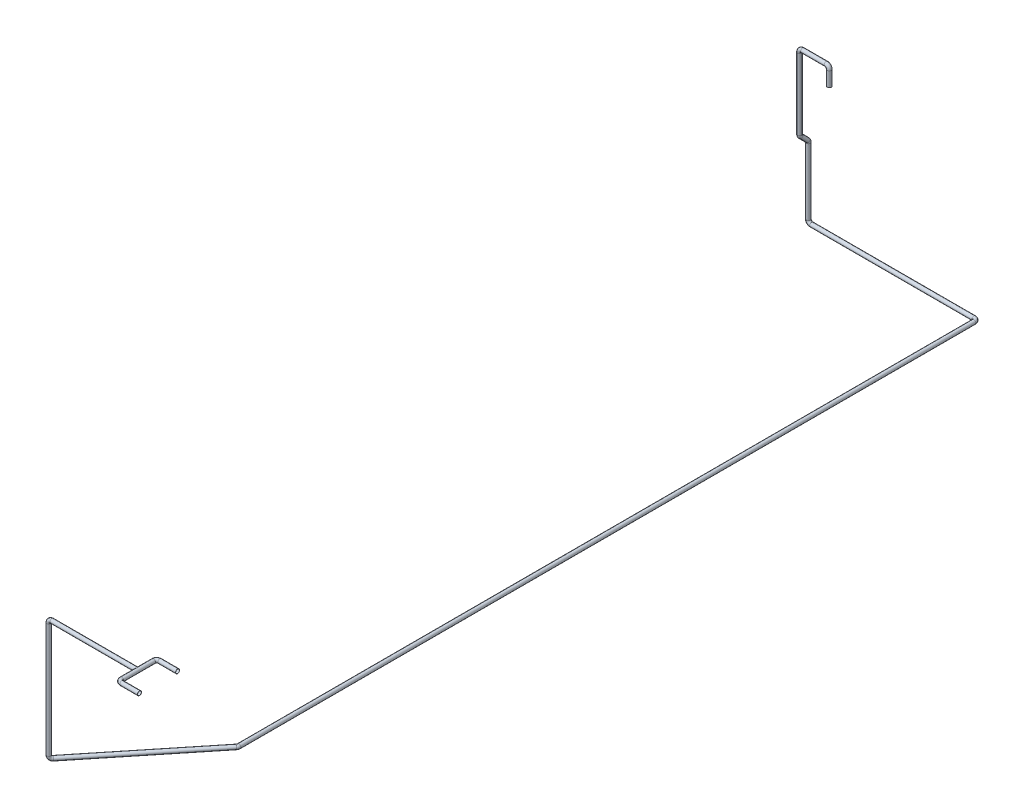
from build123d import *

# Parameters (mm, degrees)
CROQUIS2_R   = 31.75
CROQUIS2_R_2 = 30.5
CROQUIS5_R   = 31.75
CROQUIS5_R_2 = 30


with BuildPart() as part:
    # Barrer1: sweep along a curve in space
    with BuildLine() as barrer1_path:
        Line((0, 0, 0), (0, 230, 0))
        ThreePointArc((0, 230, 0), (-14.644660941, 265.355339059, 0), (-50, 280, 0))
        Line((-50, 280, 0), (-420, 280, 0))
        ThreePointArc((-420, 280, 0), (-455.355339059, 265.355339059, 0), (-470, 230, 0))
        Line((-470, 230, 0), (-470, -889.289321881, 0))
        ThreePointArc((-470, -889.289321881, 0), (-470, -908.4234935, -3.806023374), (-470, -924.644660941, -14.644660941))
        Line((-470, -924.644660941, -14.644660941), (-470, -1035.355339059, -125.355339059))
        ThreePointArc((-470, -1035.355339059, -125.355339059), (-470, -1051.5765065, -136.193976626), (-470, -1070.710678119, -140))
        Line((-470, -1070.710678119, -140), (-470, -2120, -140))
        ThreePointArc((-470, -2120, -140), (-455.355339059, -2155.355339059, -140), (-420, -2170, -140))
        Line((-420, -2170, -140), (2140, -2170, -140))
        ThreePointArc((2140, -2170, -140), (2175.355339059, -2170, -125.355339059), (2190, -2170, -90))
        Line((2190, -2170, -90), (2190, -2170, 11502.343161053))
        ThreePointArc((2190, -2170, 11502.343161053), (2187.146621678, -2170, 11518.99236717), (2178.912157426, -2170, 11533.741313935))
        Line((2178.912157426, -2170, 11533.741313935), (891.398152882, -2170, 13129.374911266))
        ThreePointArc((891.398152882, -2170, 13129.374911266), (869.196306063, -2155.355339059, 13156.889961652), (860, -2120, 13168.287068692))
        Line((860, -2120, 13168.287068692), (860, -314, 13168.287068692))
        ThreePointArc((860, -314, 13168.287068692), (874.644660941, -278.644660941, 13168.287068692), (910, -264, 13168.287068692))
        Line((910, -264, 13168.287068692), (2260, -264, 13168.287068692))
    # Croquis2 → Barrer1 (sweep)
    with BuildSketch(Plane(origin=(0, 0, 0), x_dir=(1, 0, 0), z_dir=(0, 1, 0))):
        Circle(CROQUIS2_R)
        Circle(CROQUIS2_R_2, mode=Mode.SUBTRACT)
    sweep(path=barrer1_path.line)

    # Barrer4: sweep along a curve in space
    with BuildLine() as barrer4_path:
        Line((2310, -264, 13468.787068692), (2590, -264, 13468.787068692))
        ThreePointArc((2260, -264, 13418.787068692), (2274.644660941, -264, 13454.142407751), (2310, -264, 13468.787068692))
        Line((2260, -264, 13168.287068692), (2260, -264, 13418.787068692))
        Line((2260, -264, 13168.287068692), (2260, -264, 12917.787068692))
        ThreePointArc((2260, -264, 12917.787068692), (2274.644660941, -264, 12882.431729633), (2310, -264, 12867.787068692))
        Line((2310, -264, 12867.787068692), (2590, -264, 12867.787068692))
    # Croquis5 → Barrer4 (sweep)
    with BuildSketch(Plane(origin=(2590, -264, 13468.787068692), x_dir=(0, 0, -1), z_dir=(1, 0, 0))):
        Circle(CROQUIS5_R)
        Circle(CROQUIS5_R_2, mode=Mode.SUBTRACT)
    sweep(path=barrer4_path.line)


solid = part.part
